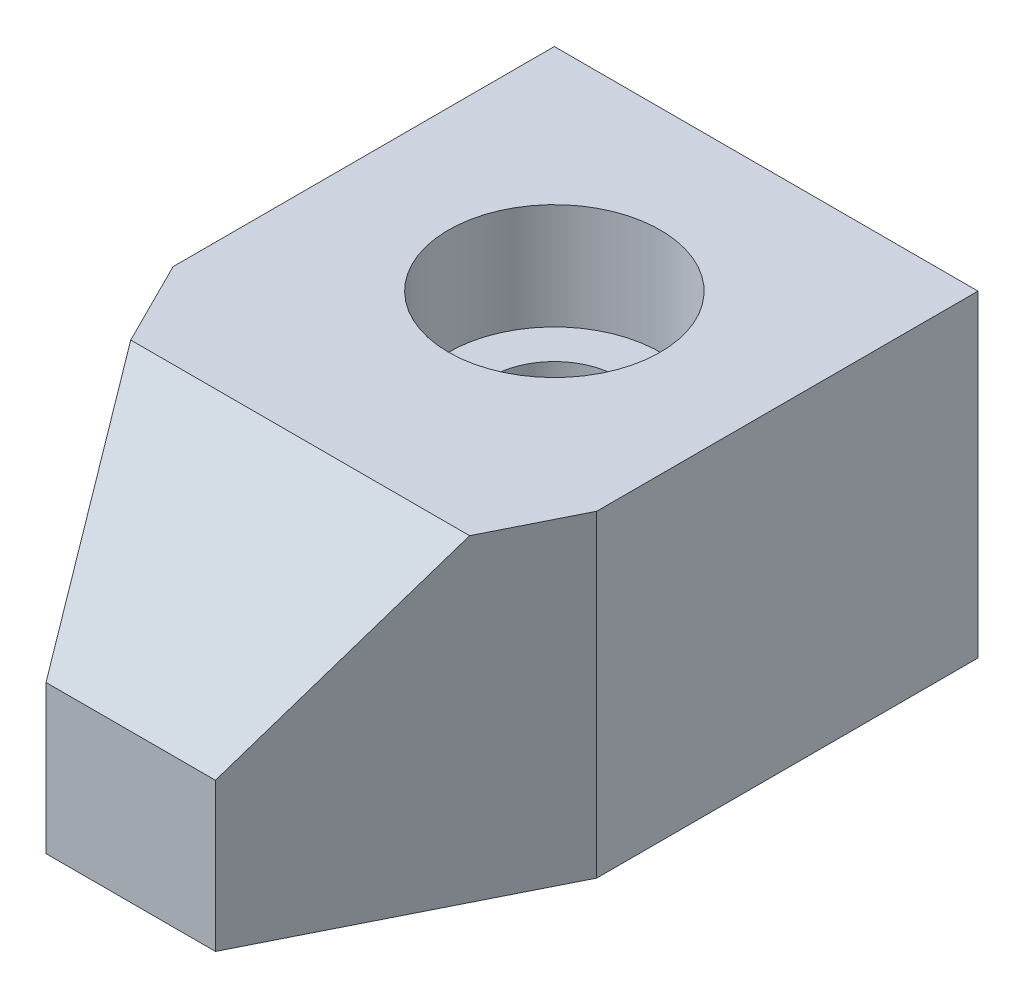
from build123d import *

# Parameters (mm, degrees)
SKETCH_1_W          = 30
SKETCH_1_H          = 15
EXTRUDE_1_DEPTH     = 20
CUT_EXTRUDE_1_DEPTH = 20
CUT_EXTRUDE_2_DEPTH = 10


with BuildPart() as part:
    # Sketch 1 → Extrude 1 (new body)
    with BuildSketch(Plane(origin=(0, 0, 0), x_dir=(0, 0, -1), z_dir=(1, 0, 0))):
        Rectangle(SKETCH_1_W, SKETCH_1_H)
    extrude(amount=EXTRUDE_1_DEPTH)

    # Sketch 3 → Cut-Revolve 1 (revolve, cut)
    with BuildSketch(Plane(origin=(10, 0, 0), x_dir=(0, 0, -1), z_dir=(1, 0, 0))):
        Polygon((5, 7.523226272), (0, 7.5), (0, 2.5), (2, 2.5), (2, -7.5), (5, -7.5), align=None)
    revolve(axis=Axis((10, 10.15105742, -5), (0, -1, 0)), mode=Mode.SUBTRACT)

    # Sketch 4 → Cut-Extrude 1 (cut)
    with BuildSketch(Plane(origin=(20, 0, 0), x_dir=(0, 0, -1), z_dir=(1, 0, 0))):
        Polygon((-15, 7.5), (-15, -0.5), (-7, 7.5), align=None)
    extrude(amount=-CUT_EXTRUDE_1_DEPTH, mode=Mode.SUBTRACT)

    # Sketch 5 → Cut-Extrude 2 (cut, symmetric)
    with BuildSketch(Plane(origin=(0, 0, 0), x_dir=(1, 0, 0), z_dir=(0, 1, 0))):
        Polygon((0, -3), (6, -15), (0, -15), align=None)
        Polygon((14, -15), (20, -15), (20, -3), align=None)
    extrude(amount=CUT_EXTRUDE_2_DEPTH, both=True, mode=Mode.SUBTRACT)


solid = part.part
